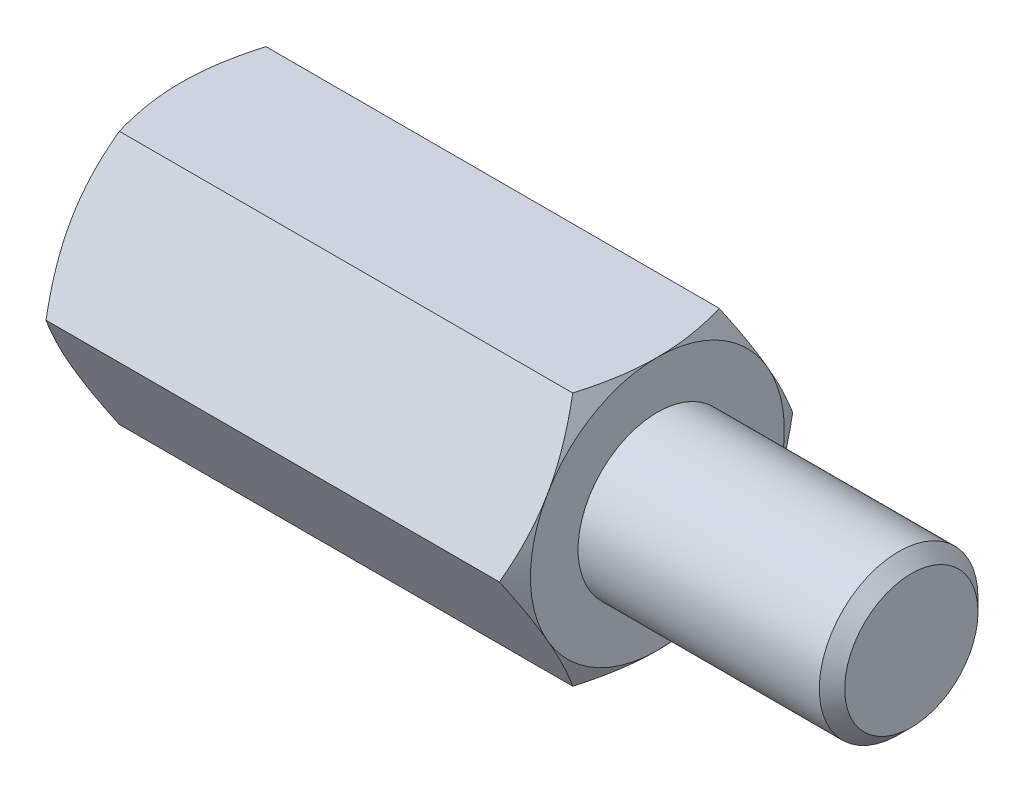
ISO-10303-21;
HEADER;
FILE_DESCRIPTION(('STEP AP214'),'2;1');
FILE_NAME('part.step','',(''),(''),'','','');
FILE_SCHEMA(('AUTOMOTIVE_DESIGN { 1 0 10303 214 1 1 1 1 }'));
ENDSEC;
DATA;
#1=APPLICATION_CONTEXT('core data for automotive mechanical design processes');
#2=APPLICATION_PROTOCOL_DEFINITION('international standard','automotive_design',2000,#1);
#3=PRODUCT_CONTEXT('',#1,'mechanical');
#4=PRODUCT('Part','Part','',(#3));
#5=PRODUCT_RELATED_PRODUCT_CATEGORY('part','',(#4));
#6=PRODUCT_DEFINITION_FORMATION('','',#4);
#7=PRODUCT_DEFINITION_CONTEXT('part definition',#1,'design');
#8=PRODUCT_DEFINITION('design','',#6,#7);
#9=PRODUCT_DEFINITION_SHAPE('','',#8);
#10=(LENGTH_UNIT() NAMED_UNIT(*) SI_UNIT(.MILLI.,.METRE.));
#11=(NAMED_UNIT(*) PLANE_ANGLE_UNIT() SI_UNIT($,.RADIAN.));
#12=(NAMED_UNIT(*) SI_UNIT($,.STERADIAN.) SOLID_ANGLE_UNIT());
#13=UNCERTAINTY_MEASURE_WITH_UNIT(LENGTH_MEASURE(1.E-05),#10,'distance_accuracy_value','');
#14=(GEOMETRIC_REPRESENTATION_CONTEXT(3) GLOBAL_UNCERTAINTY_ASSIGNED_CONTEXT((#13)) GLOBAL_UNIT_ASSIGNED_CONTEXT((#10,
#11,#12)) REPRESENTATION_CONTEXT('',''));
#15=CARTESIAN_POINT('',(0.,0.,0.));
#16=DIRECTION('',(0.,0.,1.));
#17=DIRECTION('',(1.,0.,0.));
#18=AXIS2_PLACEMENT_3D('',#15,#16,#17);
#19=CARTESIAN_POINT('',(7.5,4.,-2.3094010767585));
#20=DIRECTION('',(1.,0.,0.));
#21=DIRECTION('',(0.,0.,-1.));
#22=AXIS2_PLACEMENT_3D('',#19,#20,#21);
#23=PLANE('',#22);
#24=CARTESIAN_POINT('',(7.5,0.,0.));
#25=DIRECTION('',(1.,0.,0.));
#26=DIRECTION('',(0.,0.,-1.));
#27=AXIS2_PLACEMENT_3D('',#24,#25,#26);
#28=CIRCLE('',#27,4.);
#29=CARTESIAN_POINT('',(7.5,-2.,-3.46410161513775));
#30=VERTEX_POINT('',#29);
#31=CARTESIAN_POINT('',(7.5,2.,-3.46410161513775));
#32=VERTEX_POINT('',#31);
#33=EDGE_CURVE('E288',#30,#32,#28,.T.);
#34=ORIENTED_EDGE('',*,*,#33,.T.);
#35=CARTESIAN_POINT('',(7.5,4.,0.));
#36=VERTEX_POINT('',#35);
#37=EDGE_CURVE('E53',#32,#36,#28,.T.);
#38=ORIENTED_EDGE('',*,*,#37,.T.);
#39=CARTESIAN_POINT('',(7.5,2.,3.46410161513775));
#40=VERTEX_POINT('',#39);
#41=EDGE_CURVE('E296',#36,#40,#28,.T.);
#42=ORIENTED_EDGE('',*,*,#41,.T.);
#43=CARTESIAN_POINT('',(7.5,-2.,3.46410161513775));
#44=VERTEX_POINT('',#43);
#45=EDGE_CURVE('E302',#40,#44,#28,.T.);
#46=ORIENTED_EDGE('',*,*,#45,.T.);
#47=CARTESIAN_POINT('',(7.5,0.,0.));
#48=DIRECTION('',(-1.,0.,0.));
#49=DIRECTION('',(0.,-1.,0.));
#50=AXIS2_PLACEMENT_3D('',#47,#48,#49);
#51=CIRCLE('',#50,4.);
#52=CARTESIAN_POINT('',(7.5,-4.,0.));
#53=VERTEX_POINT('',#52);
#54=EDGE_CURVE('E193',#53,#44,#51,.T.);
#55=ORIENTED_EDGE('',*,*,#54,.F.);
#56=EDGE_CURVE('E61',#53,#30,#28,.T.);
#57=ORIENTED_EDGE('',*,*,#56,.T.);
#58=EDGE_LOOP('',(#34,#38,#42,#46,#55,#57));
#59=FACE_BOUND('',#58,.T.);
#60=CARTESIAN_POINT('',(7.5,0.,0.));
#61=DIRECTION('',(1.,0.,0.));
#62=DIRECTION('',(0.,0.,-1.));
#63=AXIS2_PLACEMENT_3D('',#60,#61,#62);
#64=CIRCLE('',#63,2.5);
#65=CARTESIAN_POINT('',(7.5,0.,-2.5));
#66=VERTEX_POINT('',#65);
#67=EDGE_CURVE('E326',#66,#66,#64,.T.);
#68=ORIENTED_EDGE('',*,*,#67,.F.);
#69=EDGE_LOOP('',(#68));
#70=FACE_BOUND('',#69,.T.);
#71=ADVANCED_FACE('F37',(#59,#70),#23,.T.);
#72=CARTESIAN_POINT('',(7.5,0.,-4.61880215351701));
#73=DIRECTION('',(0.,-0.5,0.866025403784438));
#74=DIRECTION('',(0.,-0.866025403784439,-0.5));
#75=AXIS2_PLACEMENT_3D('',#72,#73,#74);
#76=PLANE('',#75);
#77=CARTESIAN_POINT('',(7.14266774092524,-0.000200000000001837,-4.61891762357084));
#78=CARTESIAN_POINT('',(7.20128212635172,0.175579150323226,-4.5174314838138));
#79=CARTESIAN_POINT('',(7.25458967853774,0.352875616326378,-4.41506932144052));
#80=CARTESIAN_POINT('',(7.3476383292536,0.710538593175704,-4.2085725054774));
#81=CARTESIAN_POINT('',(7.3873465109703,0.890911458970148,-4.10443418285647));
#82=CARTESIAN_POINT('',(7.44915778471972,1.24942181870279,-3.89744813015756));
#83=CARTESIAN_POINT('',(7.47167226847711,1.42750415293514,-3.79463224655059));
#84=CARTESIAN_POINT('',(7.49854937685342,1.78450671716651,-3.58851671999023));
#85=CARTESIAN_POINT('',(7.50293425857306,1.9634256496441,-3.48521782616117));
#86=CARTESIAN_POINT('',(7.49380992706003,2.29774284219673,-3.29219970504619));
#87=CARTESIAN_POINT('',(7.48254104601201,2.45319115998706,-3.20245157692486));
#88=CARTESIAN_POINT('',(7.44682600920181,2.76307505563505,-3.02354002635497));
#89=CARTESIAN_POINT('',(7.42236765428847,2.91750956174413,-2.93437722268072));
#90=CARTESIAN_POINT('',(7.36122393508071,3.22803232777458,-2.75509682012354));
#91=CARTESIAN_POINT('',(7.32427939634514,3.3840812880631,-2.6650019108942));
#92=CARTESIAN_POINT('',(7.24042992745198,3.69385183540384,-2.486155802));
#93=CARTESIAN_POINT('',(7.19354469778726,3.84757739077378,-2.39740231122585));
#94=CARTESIAN_POINT('',(7.14266774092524,4.0002,-2.30928560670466));
#95=B_SPLINE_CURVE_WITH_KNOTS('',3,(#77,#78,#79,#80,#81,#82,#83,#84,#85,#86,#87,#88,#89,#90,#91,
#92,#93,#94),.UNSPECIFIED.,.F.,.F.,(4,2,2,2,2,2,2,2,4),(0.,0.634047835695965,1.26961969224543,
1.88946157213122,2.50854226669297,3.04757825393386,3.58711366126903,4.13861653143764,
4.68903648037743),.UNSPECIFIED.);
#96=CARTESIAN_POINT('',(7.14273441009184,0.,-4.61880215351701));
#97=VERTEX_POINT('',#96);
#98=EDGE_CURVE('E364',#97,#32,#95,.T.);
#99=ORIENTED_EDGE('',*,*,#98,.F.);
#100=DIRECTION('',(-1.,0.,0.));
#101=VECTOR('',#100,1.);
#102=CARTESIAN_POINT('',(7.5,0.,-4.61880215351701));
#103=LINE('',#102,#101);
#104=CARTESIAN_POINT('',(-7.14273441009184,0.,-4.61880215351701));
#105=VERTEX_POINT('',#104);
#106=EDGE_CURVE('E264',#97,#105,#103,.T.);
#107=ORIENTED_EDGE('',*,*,#106,.T.);
#108=CARTESIAN_POINT('',(-7.14266774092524,4.0002,-2.30928560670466));
#109=CARTESIAN_POINT('',(-7.20128212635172,3.82442084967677,-2.4107717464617));
#110=CARTESIAN_POINT('',(-7.25458967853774,3.64712438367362,-2.51313390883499));
#111=CARTESIAN_POINT('',(-7.3476383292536,3.28946140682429,-2.71963072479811));
#112=CARTESIAN_POINT('',(-7.3873465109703,3.10908854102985,-2.82376904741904));
#113=CARTESIAN_POINT('',(-7.44915778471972,2.75057818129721,-3.03075510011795));
#114=CARTESIAN_POINT('',(-7.47167226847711,2.57249584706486,-3.13357098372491));
#115=CARTESIAN_POINT('',(-7.49854937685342,2.21549328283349,-3.33968651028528));
#116=CARTESIAN_POINT('',(-7.50293425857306,2.0365743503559,-3.44298540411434));
#117=CARTESIAN_POINT('',(-7.49380992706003,1.70225715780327,-3.63600352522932));
#118=CARTESIAN_POINT('',(-7.48254104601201,1.54680884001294,-3.72575165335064));
#119=CARTESIAN_POINT('',(-7.44682600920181,1.23692494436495,-3.90466320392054));
#120=CARTESIAN_POINT('',(-7.42236765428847,1.08249043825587,-3.99382600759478));
#121=CARTESIAN_POINT('',(-7.36122393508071,0.771967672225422,-4.17310641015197));
#122=CARTESIAN_POINT('',(-7.32427939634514,0.615918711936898,-4.26320131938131));
#123=CARTESIAN_POINT('',(-7.24042992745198,0.30614816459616,-4.4420474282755));
#124=CARTESIAN_POINT('',(-7.19354469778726,0.152422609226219,-4.53080091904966));
#125=CARTESIAN_POINT('',(-7.14266774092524,-0.000200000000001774,-4.61891762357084));
#126=B_SPLINE_CURVE_WITH_KNOTS('',3,(#108,#109,#110,#111,#112,#113,#114,#115,#116,#117,#118,
#119,#120,#121,#122,#123,#124,#125),.UNSPECIFIED.,.F.,.F.,(4,2,2,2,2,2,2,2,4),(0.,
0.634047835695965,1.26961969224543,1.88946157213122,2.50854226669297,3.04757825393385,
3.58711366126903,4.13861653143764,4.68903648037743),.UNSPECIFIED.);
#127=CARTESIAN_POINT('',(-7.5,2.,-3.46410161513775));
#128=VERTEX_POINT('',#127);
#129=EDGE_CURVE('E416',#128,#105,#126,.T.);
#130=ORIENTED_EDGE('',*,*,#129,.F.);
#131=CARTESIAN_POINT('',(-7.14273441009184,4.,-2.3094010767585));
#132=VERTEX_POINT('',#131);
#133=EDGE_CURVE('E399',#132,#128,#126,.T.);
#134=ORIENTED_EDGE('',*,*,#133,.F.);
#135=DIRECTION('',(-1.,0.,0.));
#136=VECTOR('',#135,1.);
#137=CARTESIAN_POINT('',(7.5,4.,-2.3094010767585));
#138=LINE('',#137,#136);
#139=CARTESIAN_POINT('',(7.14273441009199,4.,-2.30940107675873));
#140=VERTEX_POINT('',#139);
#141=EDGE_CURVE('E279',#140,#132,#138,.T.);
#142=ORIENTED_EDGE('',*,*,#141,.F.);
#143=EDGE_CURVE('E229',#32,#140,#95,.T.);
#144=ORIENTED_EDGE('',*,*,#143,.F.);
#145=EDGE_LOOP('',(#99,#107,#130,#134,#142,#144));
#146=FACE_BOUND('',#145,.T.);
#147=ADVANCED_FACE('F148',(#146),#76,.F.);
#148=CARTESIAN_POINT('',(7.5,4.,-2.3094010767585));
#149=DIRECTION('',(0.,-1.,0.));
#150=DIRECTION('',(0.,0.,-1.));
#151=AXIS2_PLACEMENT_3D('',#148,#149,#150);
#152=PLANE('',#151);
#153=CARTESIAN_POINT('',(5.50829070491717,4.,-6.28479524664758));
#154=CARTESIAN_POINT('',(5.59370060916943,4.,-6.10939349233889));
#155=CARTESIAN_POINT('',(5.6783148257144,4.,-5.93359774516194));
#156=CARTESIAN_POINT('',(5.84550596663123,4.,-5.58100905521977));
#157=CARTESIAN_POINT('',(5.92808258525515,4.,-5.40421596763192));
#158=CARTESIAN_POINT('',(6.09115082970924,4.,-5.04855089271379));
#159=CARTESIAN_POINT('',(6.17162934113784,4.,-4.86967287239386));
#160=CARTESIAN_POINT('',(6.32940015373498,4.,-4.51052237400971));
#161=CARTESIAN_POINT('',(6.40669260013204,4.,-4.33024995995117));
#162=CARTESIAN_POINT('',(6.55980205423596,4.,-3.96189114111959));
#163=CARTESIAN_POINT('',(6.63548049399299,4.,-3.77374683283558));
#164=CARTESIAN_POINT('',(6.78130452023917,4.,-3.39528725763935));
#165=CARTESIAN_POINT('',(6.85144949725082,4.,-3.2049717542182));
#166=CARTESIAN_POINT('',(6.9844245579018,4.,-2.82219775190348));
#167=CARTESIAN_POINT('',(7.0472687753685,4.,-2.62974421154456));
#168=CARTESIAN_POINT('',(7.16367969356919,4.,-2.24207725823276));
#169=CARTESIAN_POINT('',(7.21724923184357,4.,-2.04686470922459));
#170=CARTESIAN_POINT('',(7.31230316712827,4.,-1.65467425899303));
#171=CARTESIAN_POINT('',(7.35385633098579,4.,-1.45771333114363));
#172=CARTESIAN_POINT('',(7.42259036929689,4.,-1.06125849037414));
#173=CARTESIAN_POINT('',(7.44977273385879,4.,-0.861764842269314));
#174=CARTESIAN_POINT('',(7.48724473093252,4.,-0.46387918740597));
#175=CARTESIAN_POINT('',(7.49775780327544,4.,-0.265508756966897));
#176=CARTESIAN_POINT('',(7.50159342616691,4.,0.131417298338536));
#177=CARTESIAN_POINT('',(7.49491584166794,4.,0.329972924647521));
#178=CARTESIAN_POINT('',(7.46964892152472,4.,0.66469218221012));
#179=CARTESIAN_POINT('',(7.45537089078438,4.,0.801202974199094));
#180=CARTESIAN_POINT('',(7.4195349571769,4.,1.07327201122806));
#181=CARTESIAN_POINT('',(7.39797613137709,4.,1.20883013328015));
#182=CARTESIAN_POINT('',(7.32350663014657,4.,1.61386939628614));
#183=CARTESIAN_POINT('',(7.26081499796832,4.,1.8815748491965));
#184=CARTESIAN_POINT('',(7.15151174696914,4.,2.28197262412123));
#185=CARTESIAN_POINT('',(7.11200931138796,4.,2.41672443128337));
#186=CARTESIAN_POINT('',(7.02875235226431,4.,2.6849206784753));
#187=CARTESIAN_POINT('',(6.98499779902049,4.,2.81836510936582));
#188=CARTESIAN_POINT('',(6.8939510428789,4.,3.08398596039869));
#189=CARTESIAN_POINT('',(6.84665989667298,4.,3.21616274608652));
#190=CARTESIAN_POINT('',(6.74911111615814,4.,3.47941134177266));
#191=CARTESIAN_POINT('',(6.6988535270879,4.,3.61048316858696));
#192=CARTESIAN_POINT('',(6.57132952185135,4.,3.93385125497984));
#193=CARTESIAN_POINT('',(6.4926014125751,4.,4.1255702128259));
#194=CARTESIAN_POINT('',(6.33096938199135,4.,4.5072455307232));
#195=CARTESIAN_POINT('',(6.24806513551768,4.,4.69720175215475));
#196=CARTESIAN_POINT('',(6.0789699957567,4.,5.0756995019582));
#197=CARTESIAN_POINT('',(5.99277827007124,4.,5.264240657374));
#198=CARTESIAN_POINT('',(5.8178011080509,4.,5.64011758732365));
#199=CARTESIAN_POINT('',(5.72901560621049,4.,5.82745333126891));
#200=CARTESIAN_POINT('',(5.45934323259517,4.,6.3884442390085));
#201=CARTESIAN_POINT('',(5.27535618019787,4.,6.76060781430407));
#202=CARTESIAN_POINT('',(4.9019562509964,4.,7.50211228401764));
#203=CARTESIAN_POINT('',(4.71254420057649,4.,7.87145359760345));
#204=CARTESIAN_POINT('',(4.34738774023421,4.,8.57450173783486));
#205=CARTESIAN_POINT('',(4.17197556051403,4.,8.90838144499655));
#206=CARTESIAN_POINT('',(3.81880976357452,4.,9.57491712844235));
#207=CARTESIAN_POINT('',(3.64105604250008,4.,9.90757304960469));
#208=CARTESIAN_POINT('',(3.28429339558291,4.,10.5709822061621));
#209=CARTESIAN_POINT('',(3.10528952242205,3.99999999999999,10.9017381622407));
#210=CARTESIAN_POINT('',(2.74590712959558,3.99999999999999,11.5624752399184));
#211=CARTESIAN_POINT('',(2.56552869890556,3.99999999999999,11.8924564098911));
#212=CARTESIAN_POINT('',(2.38464248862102,3.99999999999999,12.2221569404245));
#213=B_SPLINE_CURVE_WITH_KNOTS('',3,(#153,#154,#155,#156,#157,#158,#159,#160,#161,#162,#163,
#164,#165,#166,#167,#168,#169,#170,#171,#172,#173,#174,#175,#176,#177,#178,#179,#180,#181,#182,
#183,#184,#185,#186,#187,#188,#189,#190,#191,#192,#193,#194,#195,#196,#197,#198,#199,#200,#201,
#202,#203,#204,#205,#206,#207,#208,#209,#210,#211,#212),.UNSPECIFIED.,.F.,.F.,(4,2,2,2,2,2,2,2,
2,2,2,2,2,2,2,2,2,2,2,2,2,2,2,2,2,2,2,2,2,4),(0.,0.585280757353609,1.17064881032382,
1.75906864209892,2.34746162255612,2.95577704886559,3.56415938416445,4.17134357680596,
4.77834167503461,5.38179402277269,5.98518378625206,6.58041501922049,7.17565092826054,
7.5872191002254,7.99883946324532,8.82250155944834,9.24373134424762,9.66496407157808,
10.086071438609,10.5071723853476,11.1288656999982,11.7506074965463,12.3725077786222,
12.9944237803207,14.2398211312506,15.4850297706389,16.6164791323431,17.7479788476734,
18.8762380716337,20.0044248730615),.UNSPECIFIED.);
#214=EDGE_CURVE('E227',#140,#36,#213,.T.);
#215=ORIENTED_EDGE('',*,*,#214,.F.);
#216=ORIENTED_EDGE('',*,*,#141,.T.);
#217=CARTESIAN_POINT('',(-5.50829070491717,4.,-6.28479524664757));
#218=CARTESIAN_POINT('',(-5.59370060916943,4.,-6.10939349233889));
#219=CARTESIAN_POINT('',(-5.6783148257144,4.,-5.93359774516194));
#220=CARTESIAN_POINT('',(-5.84550596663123,4.,-5.58100905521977));
#221=CARTESIAN_POINT('',(-5.92808258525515,4.,-5.40421596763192));
#222=CARTESIAN_POINT('',(-6.09115082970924,4.,-5.04855089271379));
#223=CARTESIAN_POINT('',(-6.17162934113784,4.,-4.86967287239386));
#224=CARTESIAN_POINT('',(-6.32940015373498,4.,-4.51052237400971));
#225=CARTESIAN_POINT('',(-6.40669260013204,4.,-4.33024995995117));
#226=CARTESIAN_POINT('',(-6.55980205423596,4.,-3.96189114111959));
#227=CARTESIAN_POINT('',(-6.635480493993,4.,-3.77374683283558));
#228=CARTESIAN_POINT('',(-6.78130452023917,4.,-3.39528725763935));
#229=CARTESIAN_POINT('',(-6.85144949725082,4.,-3.2049717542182));
#230=CARTESIAN_POINT('',(-6.9844245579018,4.,-2.82219775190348));
#231=CARTESIAN_POINT('',(-7.0472687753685,4.,-2.62974421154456));
#232=CARTESIAN_POINT('',(-7.16367969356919,4.,-2.24207725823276));
#233=CARTESIAN_POINT('',(-7.21724923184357,4.,-2.04686470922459));
#234=CARTESIAN_POINT('',(-7.31230316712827,4.,-1.65467425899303));
#235=CARTESIAN_POINT('',(-7.35385633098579,4.,-1.45771333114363));
#236=CARTESIAN_POINT('',(-7.42259036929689,4.,-1.06125849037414));
#237=CARTESIAN_POINT('',(-7.44977273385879,4.,-0.861764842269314));
#238=CARTESIAN_POINT('',(-7.48724473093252,4.,-0.46387918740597));
#239=CARTESIAN_POINT('',(-7.49775780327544,4.,-0.265508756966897));
#240=CARTESIAN_POINT('',(-7.50159342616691,4.,0.131417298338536));
#241=CARTESIAN_POINT('',(-7.49491584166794,4.,0.329972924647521));
#242=CARTESIAN_POINT('',(-7.46964892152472,4.,0.66469218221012));
#243=CARTESIAN_POINT('',(-7.45537089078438,4.,0.801202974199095));
#244=CARTESIAN_POINT('',(-7.4195349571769,4.,1.07327201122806));
#245=CARTESIAN_POINT('',(-7.39797613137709,4.,1.20883013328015));
#246=CARTESIAN_POINT('',(-7.32350663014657,4.,1.61386939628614));
#247=CARTESIAN_POINT('',(-7.26081499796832,4.,1.8815748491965));
#248=CARTESIAN_POINT('',(-7.15151174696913,4.,2.28197262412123));
#249=CARTESIAN_POINT('',(-7.11200931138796,4.,2.41672443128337));
#250=CARTESIAN_POINT('',(-7.02875235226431,4.,2.68492067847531));
#251=CARTESIAN_POINT('',(-6.98499779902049,4.,2.81836510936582));
#252=CARTESIAN_POINT('',(-6.8939510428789,4.,3.08398596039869));
#253=CARTESIAN_POINT('',(-6.84665989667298,4.,3.21616274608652));
#254=CARTESIAN_POINT('',(-6.74911111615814,4.,3.47941134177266));
#255=CARTESIAN_POINT('',(-6.6988535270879,4.,3.61048316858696));
#256=CARTESIAN_POINT('',(-6.57132952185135,4.,3.93385125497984));
#257=CARTESIAN_POINT('',(-6.4926014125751,4.,4.1255702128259));
#258=CARTESIAN_POINT('',(-6.33096938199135,4.,4.5072455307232));
#259=CARTESIAN_POINT('',(-6.24806513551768,4.,4.69720175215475));
#260=CARTESIAN_POINT('',(-6.0789699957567,4.,5.0756995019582));
#261=CARTESIAN_POINT('',(-5.99277827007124,4.,5.264240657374));
#262=CARTESIAN_POINT('',(-5.8178011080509,4.,5.64011758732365));
#263=CARTESIAN_POINT('',(-5.72901560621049,4.,5.82745333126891));
#264=CARTESIAN_POINT('',(-5.45934323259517,4.,6.3884442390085));
#265=CARTESIAN_POINT('',(-5.27535618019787,4.,6.76060781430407));
#266=CARTESIAN_POINT('',(-4.9019562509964,4.,7.50211228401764));
#267=CARTESIAN_POINT('',(-4.71254420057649,4.,7.87145359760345));
#268=CARTESIAN_POINT('',(-4.34738774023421,4.,8.57450173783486));
#269=CARTESIAN_POINT('',(-4.17197556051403,4.,8.90838144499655));
#270=CARTESIAN_POINT('',(-3.81880976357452,4.,9.57491712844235));
#271=CARTESIAN_POINT('',(-3.64105604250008,4.,9.9075730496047));
#272=CARTESIAN_POINT('',(-3.28429339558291,4.,10.5709822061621));
#273=CARTESIAN_POINT('',(-3.10528952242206,3.99999999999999,10.9017381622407));
#274=CARTESIAN_POINT('',(-2.74590712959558,3.99999999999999,11.5624752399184));
#275=CARTESIAN_POINT('',(-2.56552869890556,3.99999999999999,11.8924564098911));
#276=CARTESIAN_POINT('',(-2.38464248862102,3.99999999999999,12.2221569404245));
#277=B_SPLINE_CURVE_WITH_KNOTS('',3,(#217,#218,#219,#220,#221,#222,#223,#224,#225,#226,#227,
#228,#229,#230,#231,#232,#233,#234,#235,#236,#237,#238,#239,#240,#241,#242,#243,#244,#245,#246,
#247,#248,#249,#250,#251,#252,#253,#254,#255,#256,#257,#258,#259,#260,#261,#262,#263,#264,#265,
#266,#267,#268,#269,#270,#271,#272,#273,#274,#275,#276),.UNSPECIFIED.,.F.,.F.,(4,2,2,2,2,2,2,2,
2,2,2,2,2,2,2,2,2,2,2,2,2,2,2,2,2,2,2,2,2,4),(0.,0.585280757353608,1.17064881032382,
1.75906864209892,2.34746162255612,2.95577704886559,3.56415938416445,4.17134357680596,
4.7783416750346,5.38179402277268,5.98518378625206,6.58041501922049,7.17565092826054,
7.5872191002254,7.99883946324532,8.82250155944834,9.24373134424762,9.66496407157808,
10.086071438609,10.5071723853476,11.1288656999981,11.7506074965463,12.3725077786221,
12.9944237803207,14.2398211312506,15.4850297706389,16.6164791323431,17.7479788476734,
18.8762380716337,20.0044248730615),.UNSPECIFIED.);
#278=CARTESIAN_POINT('',(-7.5,4.,0.));
#279=VERTEX_POINT('',#278);
#280=EDGE_CURVE('E241',#279,#132,#277,.F.);
#281=ORIENTED_EDGE('',*,*,#280,.F.);
#282=CARTESIAN_POINT('',(-7.14273441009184,4.,2.3094010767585));
#283=VERTEX_POINT('',#282);
#284=EDGE_CURVE('E249',#283,#279,#277,.F.);
#285=ORIENTED_EDGE('',*,*,#284,.F.);
#286=DIRECTION('',(-1.,0.,0.));
#287=VECTOR('',#286,1.);
#288=CARTESIAN_POINT('',(7.5,4.,2.3094010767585));
#289=LINE('',#288,#287);
#290=CARTESIAN_POINT('',(7.14273441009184,4.,2.3094010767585));
#291=VERTEX_POINT('',#290);
#292=EDGE_CURVE('E276',#291,#283,#289,.T.);
#293=ORIENTED_EDGE('',*,*,#292,.F.);
#294=EDGE_CURVE('E221',#36,#291,#213,.T.);
#295=ORIENTED_EDGE('',*,*,#294,.F.);
#296=EDGE_LOOP('',(#215,#216,#281,#285,#293,#295));
#297=FACE_BOUND('',#296,.T.);
#298=ADVANCED_FACE('F153',(#297),#152,.F.);
#299=CARTESIAN_POINT('',(7.5,4.,2.3094010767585));
#300=DIRECTION('',(0.,-0.5,-0.866025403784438));
#301=DIRECTION('',(0.,0.866025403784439,-0.5));
#302=AXIS2_PLACEMENT_3D('',#299,#300,#301);
#303=PLANE('',#302);
#304=CARTESIAN_POINT('',(7.14266774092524,4.0002,2.30928560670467));
#305=CARTESIAN_POINT('',(7.20128212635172,3.82442084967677,2.4107717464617));
#306=CARTESIAN_POINT('',(7.25458967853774,3.64712438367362,2.51313390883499));
#307=CARTESIAN_POINT('',(7.3476383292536,3.28946140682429,2.71963072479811));
#308=CARTESIAN_POINT('',(7.3873465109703,3.10908854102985,2.82376904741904));
#309=CARTESIAN_POINT('',(7.44915778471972,2.75057818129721,3.03075510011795));
#310=CARTESIAN_POINT('',(7.47167226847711,2.57249584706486,3.13357098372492));
#311=CARTESIAN_POINT('',(7.49854937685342,2.21549328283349,3.33968651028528));
#312=CARTESIAN_POINT('',(7.50293425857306,2.0365743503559,3.44298540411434));
#313=CARTESIAN_POINT('',(7.49380992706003,1.70225715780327,3.63600352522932));
#314=CARTESIAN_POINT('',(7.48254104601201,1.54680884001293,3.72575165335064));
#315=CARTESIAN_POINT('',(7.44682600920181,1.23692494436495,3.90466320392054));
#316=CARTESIAN_POINT('',(7.42236765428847,1.08249043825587,3.99382600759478));
#317=CARTESIAN_POINT('',(7.36122393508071,0.771967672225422,4.17310641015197));
#318=CARTESIAN_POINT('',(7.32427939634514,0.615918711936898,4.26320131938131));
#319=CARTESIAN_POINT('',(7.24042992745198,0.306148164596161,4.4420474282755));
#320=CARTESIAN_POINT('',(7.19354469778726,0.152422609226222,4.53080091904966));
#321=CARTESIAN_POINT('',(7.14266774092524,-0.000199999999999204,4.61891762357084));
#322=B_SPLINE_CURVE_WITH_KNOTS('',3,(#304,#305,#306,#307,#308,#309,#310,#311,#312,#313,#314,
#315,#316,#317,#318,#319,#320,#321),.UNSPECIFIED.,.F.,.F.,(4,2,2,2,2,2,2,2,4),(0.,
0.634047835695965,1.26961969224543,1.88946157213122,2.50854226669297,3.04757825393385,
3.58711366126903,4.13861653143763,4.68903648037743),.UNSPECIFIED.);
#323=EDGE_CURVE('E228',#291,#40,#322,.T.);
#324=ORIENTED_EDGE('',*,*,#323,.F.);
#325=ORIENTED_EDGE('',*,*,#292,.T.);
#326=CARTESIAN_POINT('',(-7.14266774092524,-0.000199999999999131,4.61891762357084));
#327=CARTESIAN_POINT('',(-7.20128212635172,0.175579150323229,4.5174314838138));
#328=CARTESIAN_POINT('',(-7.25458967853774,0.352875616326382,4.41506932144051));
#329=CARTESIAN_POINT('',(-7.3476383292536,0.710538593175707,4.20857250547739));
#330=CARTESIAN_POINT('',(-7.3873465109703,0.890911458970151,4.10443418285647));
#331=CARTESIAN_POINT('',(-7.44915778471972,1.24942181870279,3.89744813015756));
#332=CARTESIAN_POINT('',(-7.47167226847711,1.42750415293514,3.79463224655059));
#333=CARTESIAN_POINT('',(-7.49854937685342,1.78450671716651,3.58851671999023));
#334=CARTESIAN_POINT('',(-7.50293425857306,1.9634256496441,3.48521782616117));
#335=CARTESIAN_POINT('',(-7.49380992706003,2.29774284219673,3.29219970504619));
#336=CARTESIAN_POINT('',(-7.48254104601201,2.45319115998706,3.20245157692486));
#337=CARTESIAN_POINT('',(-7.44682600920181,2.76307505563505,3.02354002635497));
#338=CARTESIAN_POINT('',(-7.42236765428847,2.91750956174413,2.93437722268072));
#339=CARTESIAN_POINT('',(-7.36122393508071,3.22803232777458,2.75509682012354));
#340=CARTESIAN_POINT('',(-7.32427939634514,3.3840812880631,2.6650019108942));
#341=CARTESIAN_POINT('',(-7.24042992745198,3.69385183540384,2.48615580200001));
#342=CARTESIAN_POINT('',(-7.19354469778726,3.84757739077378,2.39740231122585));
#343=CARTESIAN_POINT('',(-7.14266774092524,4.0002,2.30928560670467));
#344=B_SPLINE_CURVE_WITH_KNOTS('',3,(#326,#327,#328,#329,#330,#331,#332,#333,#334,#335,#336,
#337,#338,#339,#340,#341,#342,#343),.UNSPECIFIED.,.F.,.F.,(4,2,2,2,2,2,2,2,4),(0.,
0.634047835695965,1.26961969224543,1.88946157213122,2.50854226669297,3.04757825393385,
3.58711366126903,4.13861653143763,4.68903648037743),.UNSPECIFIED.);
#345=CARTESIAN_POINT('',(-7.5,2.,3.46410161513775));
#346=VERTEX_POINT('',#345);
#347=EDGE_CURVE('E255',#346,#283,#344,.T.);
#348=ORIENTED_EDGE('',*,*,#347,.F.);
#349=CARTESIAN_POINT('',(-7.14273441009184,0.,4.618802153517));
#350=VERTEX_POINT('',#349);
#351=EDGE_CURVE('E262',#350,#346,#344,.T.);
#352=ORIENTED_EDGE('',*,*,#351,.F.);
#353=DIRECTION('',(-1.,0.,0.));
#354=VECTOR('',#353,1.);
#355=CARTESIAN_POINT('',(7.5,0.,4.618802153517));
#356=LINE('',#355,#354);
#357=CARTESIAN_POINT('',(7.14273441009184,0.,4.618802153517));
#358=VERTEX_POINT('',#357);
#359=EDGE_CURVE('E273',#358,#350,#356,.T.);
#360=ORIENTED_EDGE('',*,*,#359,.F.);
#361=EDGE_CURVE('E215',#40,#358,#322,.T.);
#362=ORIENTED_EDGE('',*,*,#361,.F.);
#363=EDGE_LOOP('',(#324,#325,#348,#352,#360,#362));
#364=FACE_BOUND('',#363,.T.);
#365=ADVANCED_FACE('F235',(#364),#303,.F.);
#366=CARTESIAN_POINT('',(7.5,0.,4.618802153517));
#367=DIRECTION('',(0.,0.5,-0.866025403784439));
#368=DIRECTION('',(0.,0.866025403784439,0.5));
#369=AXIS2_PLACEMENT_3D('',#366,#367,#368);
#370=PLANE('',#369);
#371=CARTESIAN_POINT('',(7.14266774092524,0.000200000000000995,4.61891762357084));
#372=CARTESIAN_POINT('',(7.20128212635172,-0.175579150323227,4.5174314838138));
#373=CARTESIAN_POINT('',(7.25458967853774,-0.352875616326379,4.41506932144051));
#374=CARTESIAN_POINT('',(7.3476383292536,-0.710538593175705,4.20857250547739));
#375=CARTESIAN_POINT('',(7.3873465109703,-0.890911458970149,4.10443418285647));
#376=CARTESIAN_POINT('',(7.44915778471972,-1.24942181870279,3.89744813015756));
#377=CARTESIAN_POINT('',(7.47167226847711,-1.42750415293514,3.79463224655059));
#378=CARTESIAN_POINT('',(7.49854937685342,-1.78450671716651,3.58851671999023));
#379=CARTESIAN_POINT('',(7.50293425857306,-1.9634256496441,3.48521782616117));
#380=CARTESIAN_POINT('',(7.49380992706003,-2.29774284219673,3.29219970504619));
#381=CARTESIAN_POINT('',(7.48254104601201,-2.45319115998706,3.20245157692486));
#382=CARTESIAN_POINT('',(7.44682600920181,-2.76307505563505,3.02354002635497));
#383=CARTESIAN_POINT('',(7.42236765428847,-2.91750956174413,2.93437722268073));
#384=CARTESIAN_POINT('',(7.36122393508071,-3.22803232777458,2.75509682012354));
#385=CARTESIAN_POINT('',(7.32427939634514,-3.3840812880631,2.6650019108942));
#386=CARTESIAN_POINT('',(7.24042992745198,-3.69385183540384,2.48615580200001));
#387=CARTESIAN_POINT('',(7.19354469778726,-3.84757739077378,2.39740231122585));
#388=CARTESIAN_POINT('',(7.14266774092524,-4.0002,2.30928560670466));
#389=B_SPLINE_CURVE_WITH_KNOTS('',3,(#371,#372,#373,#374,#375,#376,#377,#378,#379,#380,#381,
#382,#383,#384,#385,#386,#387,#388),.UNSPECIFIED.,.F.,.F.,(4,2,2,2,2,2,2,2,4),(0.,
0.634047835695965,1.26961969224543,1.88946157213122,2.50854226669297,3.04757825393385,
3.58711366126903,4.13861653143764,4.68903648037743),.UNSPECIFIED.);
#390=EDGE_CURVE('E384',#358,#44,#389,.T.);
#391=ORIENTED_EDGE('',*,*,#390,.F.);
#392=ORIENTED_EDGE('',*,*,#359,.T.);
#393=CARTESIAN_POINT('',(-7.14266774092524,-4.0002,2.30928560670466));
#394=CARTESIAN_POINT('',(-7.20128212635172,-3.82442084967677,2.4107717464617));
#395=CARTESIAN_POINT('',(-7.25458967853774,-3.64712438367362,2.51313390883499));
#396=CARTESIAN_POINT('',(-7.3476383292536,-3.28946140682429,2.71963072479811));
#397=CARTESIAN_POINT('',(-7.3873465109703,-3.10908854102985,2.82376904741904));
#398=CARTESIAN_POINT('',(-7.44915778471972,-2.75057818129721,3.03075510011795));
#399=CARTESIAN_POINT('',(-7.47167226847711,-2.57249584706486,3.13357098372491));
#400=CARTESIAN_POINT('',(-7.49854937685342,-2.21549328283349,3.33968651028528));
#401=CARTESIAN_POINT('',(-7.50293425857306,-2.0365743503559,3.44298540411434));
#402=CARTESIAN_POINT('',(-7.49380992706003,-1.70225715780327,3.63600352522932));
#403=CARTESIAN_POINT('',(-7.48254104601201,-1.54680884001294,3.72575165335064));
#404=CARTESIAN_POINT('',(-7.44682600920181,-1.23692494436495,3.90466320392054));
#405=CARTESIAN_POINT('',(-7.42236765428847,-1.08249043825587,3.99382600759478));
#406=CARTESIAN_POINT('',(-7.36122393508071,-0.771967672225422,4.17310641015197));
#407=CARTESIAN_POINT('',(-7.32427939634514,-0.615918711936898,4.26320131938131));
#408=CARTESIAN_POINT('',(-7.24042992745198,-0.30614816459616,4.4420474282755));
#409=CARTESIAN_POINT('',(-7.19354469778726,-0.15242260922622,4.53080091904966));
#410=CARTESIAN_POINT('',(-7.14266774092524,0.000200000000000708,4.61891762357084));
#411=B_SPLINE_CURVE_WITH_KNOTS('',3,(#393,#394,#395,#396,#397,#398,#399,#400,#401,#402,#403,
#404,#405,#406,#407,#408,#409,#410),.UNSPECIFIED.,.F.,.F.,(4,2,2,2,2,2,2,2,4),(0.,
0.634047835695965,1.26961969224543,1.88946157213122,2.50854226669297,3.04757825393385,
3.58711366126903,4.13861653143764,4.68903648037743),.UNSPECIFIED.);
#412=CARTESIAN_POINT('',(-7.5,-2.,3.46410161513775));
#413=VERTEX_POINT('',#412);
#414=EDGE_CURVE('E263',#413,#350,#411,.T.);
#415=ORIENTED_EDGE('',*,*,#414,.F.);
#416=CARTESIAN_POINT('',(-7.14273441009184,-4.,2.3094010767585));
#417=VERTEX_POINT('',#416);
#418=EDGE_CURVE('E250',#417,#413,#411,.T.);
#419=ORIENTED_EDGE('',*,*,#418,.F.);
#420=DIRECTION('',(-1.,0.,0.));
#421=VECTOR('',#420,1.);
#422=CARTESIAN_POINT('',(7.5,-4.,2.3094010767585));
#423=LINE('',#422,#421);
#424=CARTESIAN_POINT('',(7.14273441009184,-4.,2.3094010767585));
#425=VERTEX_POINT('',#424);
#426=EDGE_CURVE('E270',#425,#417,#423,.T.);
#427=ORIENTED_EDGE('',*,*,#426,.F.);
#428=EDGE_CURVE('E210',#44,#425,#389,.T.);
#429=ORIENTED_EDGE('',*,*,#428,.F.);
#430=EDGE_LOOP('',(#391,#392,#415,#419,#427,#429));
#431=FACE_BOUND('',#430,.T.);
#432=ADVANCED_FACE('F467',(#431),#370,.F.);
#433=CARTESIAN_POINT('',(7.5,-4.,2.3094010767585));
#434=DIRECTION('',(0.,1.,0.));
#435=DIRECTION('',(0.,0.,1.));
#436=AXIS2_PLACEMENT_3D('',#433,#434,#435);
#437=PLANE('',#436);
#438=CARTESIAN_POINT('',(5.5082907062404,-4.,-6.28479524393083));
#439=CARTESIAN_POINT('',(5.59370061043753,-4.,-6.10939348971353));
#440=CARTESIAN_POINT('',(5.6783148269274,-4.,-5.93359774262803));
#441=CARTESIAN_POINT('',(5.84550596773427,-4.,-5.58100905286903));
#442=CARTESIAN_POINT('',(5.92808258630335,-4.,-5.40421596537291));
#443=CARTESIAN_POINT('',(6.09115083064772,-4.,-5.04855089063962));
#444=CARTESIAN_POINT('',(6.17162934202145,-4.,-4.86967287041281));
#445=CARTESIAN_POINT('',(6.32940015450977,-4.,-4.51052237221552));
#446=CARTESIAN_POINT('',(6.40669260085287,-4.,-4.33024995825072));
#447=CARTESIAN_POINT('',(6.55980205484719,-4.,-3.96189113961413));
#448=CARTESIAN_POINT('',(6.63548049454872,-4.,-3.77374683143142));
#449=CARTESIAN_POINT('',(6.78130452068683,-4.,-3.39528725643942));
#450=CARTESIAN_POINT('',(6.85144949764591,-4.,-3.2049717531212));
#451=CARTESIAN_POINT('',(6.98442455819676,-4.,-2.82219775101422));
#452=CARTESIAN_POINT('',(7.04726877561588,-4.,-2.62974421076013));
#453=CARTESIAN_POINT('',(7.16367969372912,-4.,-2.24207725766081));
#454=CARTESIAN_POINT('',(7.21724923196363,-4.,-2.04686470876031));
#455=CARTESIAN_POINT('',(7.31230316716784,-4.,-1.65467425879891));
#456=CARTESIAN_POINT('',(7.35385633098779,-4.,-1.45771333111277));
#457=CARTESIAN_POINT('',(7.4225903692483,-4.,-1.06125849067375));
#458=CARTESIAN_POINT('',(7.44977273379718,-4.,-0.861764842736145));
#459=CARTESIAN_POINT('',(7.48724473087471,-4.,-0.463879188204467));
#460=CARTESIAN_POINT('',(7.49775780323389,-4.,-0.265508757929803));
#461=CARTESIAN_POINT('',(7.50159342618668,-4.,0.131417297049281));
#462=CARTESIAN_POINT('',(7.49491584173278,-4.,0.329972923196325));
#463=CARTESIAN_POINT('',(7.46964892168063,-4.,0.664692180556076));
#464=CARTESIAN_POINT('',(7.45537089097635,-4.,0.80120297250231));
#465=CARTESIAN_POINT('',(7.4195349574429,-4.,1.07327200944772));
#466=CARTESIAN_POINT('',(7.39797613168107,-4.,1.208830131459));
#467=CARTESIAN_POINT('',(7.32350663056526,-4.,1.6138693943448));
#468=CARTESIAN_POINT('',(7.26081499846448,-4.,1.88157484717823));
#469=CARTESIAN_POINT('',(7.15151174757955,-4.,2.28197262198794));
#470=CARTESIAN_POINT('',(7.1120093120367,-4.,2.41672442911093));
#471=CARTESIAN_POINT('',(7.02875235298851,-4.,2.68492067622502));
#472=CARTESIAN_POINT('',(6.98499779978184,-4.,2.81836510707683));
#473=CARTESIAN_POINT('',(6.89395104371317,-4.,3.0839859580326));
#474=CARTESIAN_POINT('',(6.84665989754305,-4.,3.21616274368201));
#475=CARTESIAN_POINT('',(6.74911111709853,-4.,3.47941133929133));
#476=CARTESIAN_POINT('',(6.69885352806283,-4.,3.61048316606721));
#477=CARTESIAN_POINT('',(6.57132952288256,-4.,3.93385125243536));
#478=CARTESIAN_POINT('',(6.49260141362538,-4.,4.12557021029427));
#479=CARTESIAN_POINT('',(6.330969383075,-4.,4.50724552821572));
#480=CARTESIAN_POINT('',(6.24806513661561,-4.,4.69720174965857));
#481=CARTESIAN_POINT('',(6.07896999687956,-4.,5.07569949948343));
#482=CARTESIAN_POINT('',(5.99277827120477,-4.,5.26424065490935));
#483=CARTESIAN_POINT('',(5.81780110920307,-4.,5.64011758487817));
#484=CARTESIAN_POINT('',(5.72901560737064,-4.,5.82745332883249));
#485=CARTESIAN_POINT('',(5.45934323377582,-4.,6.38844423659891));
#486=CARTESIAN_POINT('',(5.27535618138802,-4.,6.76060781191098));
#487=CARTESIAN_POINT('',(4.90195625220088,-4.,7.50211228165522));
#488=CARTESIAN_POINT('',(4.71254420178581,-4.,7.87145359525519));
#489=CARTESIAN_POINT('',(4.34738774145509,-4.,8.57450173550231));
#490=CARTESIAN_POINT('',(4.171975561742,-4.,8.90838144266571));
#491=CARTESIAN_POINT('',(3.81880976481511,-4.,9.5749171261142));
#492=CARTESIAN_POINT('',(3.6410560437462,-4.,9.90757304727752));
#493=CARTESIAN_POINT('',(3.28429339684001,-4.,10.5709822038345));
#494=CARTESIAN_POINT('',(3.10528952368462,-4.,10.9017381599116));
#495=CARTESIAN_POINT('',(2.74590713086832,-4.,11.562475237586));
#496=CARTESIAN_POINT('',(2.56552870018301,-4.,11.8924564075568));
#497=CARTESIAN_POINT('',(2.38464248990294,-4.,12.2221569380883));
#498=B_SPLINE_CURVE_WITH_KNOTS('',3,(#438,#439,#440,#441,#442,#443,#444,#445,#446,#447,#448,
#449,#450,#451,#452,#453,#454,#455,#456,#457,#458,#459,#460,#461,#462,#463,#464,#465,#466,#467,
#468,#469,#470,#471,#472,#473,#474,#475,#476,#477,#478,#479,#480,#481,#482,#483,#484,#485,#486,
#487,#488,#489,#490,#491,#492,#493,#494,#495,#496,#497),.UNSPECIFIED.,.F.,.F.,(4,2,2,2,2,2,2,2,
2,2,2,2,2,2,2,2,2,2,2,2,2,2,2,2,2,2,2,2,2,4),(0.,0.585280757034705,1.17064880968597,
1.75906864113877,2.34746162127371,2.95577704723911,3.56415938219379,4.17134357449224,
4.7783416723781,5.38179401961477,5.98518378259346,6.58041501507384,7.1756509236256,
7.5872190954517,7.99883945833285,8.82250155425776,9.24373133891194,9.66496406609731,
10.0860714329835,10.5071723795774,11.1288656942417,11.7506074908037,12.3725077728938,
12.9944237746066,14.2398211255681,15.4850297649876,16.6164791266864,17.7479788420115,
18.8762380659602,20.0044248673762),.UNSPECIFIED.);
#499=EDGE_CURVE('E389',#425,#53,#498,.F.);
#500=ORIENTED_EDGE('',*,*,#499,.F.);
#501=ORIENTED_EDGE('',*,*,#426,.T.);
#502=CARTESIAN_POINT('',(-5.5082907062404,-4.,-6.28479524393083));
#503=CARTESIAN_POINT('',(-5.59370061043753,-4.,-6.10939348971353));
#504=CARTESIAN_POINT('',(-5.6783148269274,-4.,-5.93359774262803));
#505=CARTESIAN_POINT('',(-5.84550596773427,-4.,-5.58100905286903));
#506=CARTESIAN_POINT('',(-5.92808258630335,-4.,-5.40421596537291));
#507=CARTESIAN_POINT('',(-6.09115083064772,-4.,-5.04855089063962));
#508=CARTESIAN_POINT('',(-6.17162934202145,-4.,-4.86967287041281));
#509=CARTESIAN_POINT('',(-6.32940015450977,-4.,-4.51052237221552));
#510=CARTESIAN_POINT('',(-6.40669260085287,-4.,-4.33024995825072));
#511=CARTESIAN_POINT('',(-6.55980205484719,-4.,-3.96189113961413));
#512=CARTESIAN_POINT('',(-6.63548049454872,-4.,-3.77374683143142));
#513=CARTESIAN_POINT('',(-6.78130452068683,-4.,-3.39528725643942));
#514=CARTESIAN_POINT('',(-6.85144949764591,-4.,-3.2049717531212));
#515=CARTESIAN_POINT('',(-6.98442455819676,-4.,-2.82219775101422));
#516=CARTESIAN_POINT('',(-7.04726877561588,-4.,-2.62974421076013));
#517=CARTESIAN_POINT('',(-7.16367969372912,-4.,-2.24207725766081));
#518=CARTESIAN_POINT('',(-7.21724923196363,-4.,-2.04686470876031));
#519=CARTESIAN_POINT('',(-7.31230316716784,-4.,-1.65467425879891));
#520=CARTESIAN_POINT('',(-7.35385633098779,-4.,-1.45771333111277));
#521=CARTESIAN_POINT('',(-7.4225903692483,-4.,-1.06125849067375));
#522=CARTESIAN_POINT('',(-7.44977273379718,-4.,-0.861764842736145));
#523=CARTESIAN_POINT('',(-7.48724473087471,-4.,-0.463879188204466));
#524=CARTESIAN_POINT('',(-7.49775780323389,-4.,-0.265508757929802));
#525=CARTESIAN_POINT('',(-7.50159342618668,-4.,0.131417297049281));
#526=CARTESIAN_POINT('',(-7.49491584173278,-4.,0.329972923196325));
#527=CARTESIAN_POINT('',(-7.46964892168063,-4.,0.664692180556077));
#528=CARTESIAN_POINT('',(-7.45537089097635,-4.,0.801202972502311));
#529=CARTESIAN_POINT('',(-7.4195349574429,-4.,1.07327200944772));
#530=CARTESIAN_POINT('',(-7.39797613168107,-4.,1.208830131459));
#531=CARTESIAN_POINT('',(-7.32350663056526,-4.,1.6138693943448));
#532=CARTESIAN_POINT('',(-7.26081499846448,-4.,1.88157484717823));
#533=CARTESIAN_POINT('',(-7.15151174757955,-4.,2.28197262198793));
#534=CARTESIAN_POINT('',(-7.1120093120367,-4.,2.41672442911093));
#535=CARTESIAN_POINT('',(-7.02875235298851,-4.,2.68492067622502));
#536=CARTESIAN_POINT('',(-6.98499779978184,-4.,2.81836510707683));
#537=CARTESIAN_POINT('',(-6.89395104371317,-4.,3.0839859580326));
#538=CARTESIAN_POINT('',(-6.84665989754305,-4.,3.21616274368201));
#539=CARTESIAN_POINT('',(-6.74911111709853,-4.,3.47941133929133));
#540=CARTESIAN_POINT('',(-6.69885352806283,-4.,3.61048316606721));
#541=CARTESIAN_POINT('',(-6.57132952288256,-4.,3.93385125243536));
#542=CARTESIAN_POINT('',(-6.49260141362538,-4.,4.12557021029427));
#543=CARTESIAN_POINT('',(-6.330969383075,-4.,4.50724552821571));
#544=CARTESIAN_POINT('',(-6.24806513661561,-4.,4.69720174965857));
#545=CARTESIAN_POINT('',(-6.07896999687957,-4.,5.07569949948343));
#546=CARTESIAN_POINT('',(-5.99277827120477,-4.,5.26424065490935));
#547=CARTESIAN_POINT('',(-5.81780110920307,-4.,5.64011758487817));
#548=CARTESIAN_POINT('',(-5.72901560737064,-4.,5.82745332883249));
#549=CARTESIAN_POINT('',(-5.45934323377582,-4.,6.38844423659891));
#550=CARTESIAN_POINT('',(-5.27535618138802,-4.,6.76060781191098));
#551=CARTESIAN_POINT('',(-4.90195625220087,-4.,7.50211228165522));
#552=CARTESIAN_POINT('',(-4.7125442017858,-4.,7.87145359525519));
#553=CARTESIAN_POINT('',(-4.34738774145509,-4.,8.57450173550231));
#554=CARTESIAN_POINT('',(-4.171975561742,-4.,8.90838144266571));
#555=CARTESIAN_POINT('',(-3.8188097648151,-4.,9.5749171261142));
#556=CARTESIAN_POINT('',(-3.6410560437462,-4.,9.90757304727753));
#557=CARTESIAN_POINT('',(-3.28429339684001,-4.,10.5709822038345));
#558=CARTESIAN_POINT('',(-3.10528952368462,-4.,10.9017381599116));
#559=CARTESIAN_POINT('',(-2.74590713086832,-4.,11.562475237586));
#560=CARTESIAN_POINT('',(-2.56552870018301,-4.,11.8924564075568));
#561=CARTESIAN_POINT('',(-2.38464248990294,-4.,12.2221569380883));
#562=B_SPLINE_CURVE_WITH_KNOTS('',3,(#502,#503,#504,#505,#506,#507,#508,#509,#510,#511,#512,
#513,#514,#515,#516,#517,#518,#519,#520,#521,#522,#523,#524,#525,#526,#527,#528,#529,#530,#531,
#532,#533,#534,#535,#536,#537,#538,#539,#540,#541,#542,#543,#544,#545,#546,#547,#548,#549,#550,
#551,#552,#553,#554,#555,#556,#557,#558,#559,#560,#561),.UNSPECIFIED.,.F.,.F.,(4,2,2,2,2,2,2,2,
2,2,2,2,2,2,2,2,2,2,2,2,2,2,2,2,2,2,2,2,2,4),(0.,0.585280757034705,1.17064880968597,
1.75906864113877,2.34746162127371,2.95577704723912,3.56415938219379,4.17134357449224,
4.7783416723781,5.38179401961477,5.98518378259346,6.58041501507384,7.1756509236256,
7.5872190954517,7.99883945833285,8.82250155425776,9.24373133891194,9.66496406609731,
10.0860714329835,10.5071723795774,11.1288656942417,11.7506074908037,12.3725077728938,
12.9944237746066,14.2398211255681,15.4850297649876,16.6164791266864,17.7479788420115,
18.8762380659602,20.0044248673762),.UNSPECIFIED.);
#563=CARTESIAN_POINT('',(-7.5,-4.,0.));
#564=VERTEX_POINT('',#563);
#565=EDGE_CURVE('E411',#564,#417,#562,.T.);
#566=ORIENTED_EDGE('',*,*,#565,.F.);
#567=CARTESIAN_POINT('',(-7.14273441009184,-4.,-2.3094010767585));
#568=VERTEX_POINT('',#567);
#569=EDGE_CURVE('E351',#568,#564,#562,.T.);
#570=ORIENTED_EDGE('',*,*,#569,.F.);
#571=DIRECTION('',(-1.,0.,0.));
#572=VECTOR('',#571,1.);
#573=CARTESIAN_POINT('',(7.5,-4.,-2.3094010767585));
#574=LINE('',#573,#572);
#575=CARTESIAN_POINT('',(7.14273441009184,-4.,-2.3094010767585));
#576=VERTEX_POINT('',#575);
#577=EDGE_CURVE('E267',#576,#568,#574,.T.);
#578=ORIENTED_EDGE('',*,*,#577,.F.);
#579=EDGE_CURVE('E195',#53,#576,#498,.F.);
#580=ORIENTED_EDGE('',*,*,#579,.F.);
#581=EDGE_LOOP('',(#500,#501,#566,#570,#578,#580));
#582=FACE_BOUND('',#581,.T.);
#583=ADVANCED_FACE('F172',(#582),#437,.F.);
#584=CARTESIAN_POINT('',(7.5,-4.,-2.3094010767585));
#585=DIRECTION('',(0.,0.5,0.866025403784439));
#586=DIRECTION('',(0.,-0.866025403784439,0.5));
#587=AXIS2_PLACEMENT_3D('',#584,#585,#586);
#588=PLANE('',#587);
#589=CARTESIAN_POINT('',(7.14266774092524,-4.0002,-2.30928560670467));
#590=CARTESIAN_POINT('',(7.20128212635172,-3.82442084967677,-2.4107717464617));
#591=CARTESIAN_POINT('',(7.25458967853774,-3.64712438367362,-2.51313390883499));
#592=CARTESIAN_POINT('',(7.3476383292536,-3.28946140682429,-2.71963072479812));
#593=CARTESIAN_POINT('',(7.3873465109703,-3.10908854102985,-2.82376904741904));
#594=CARTESIAN_POINT('',(7.44915778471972,-2.75057818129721,-3.03075510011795));
#595=CARTESIAN_POINT('',(7.47167226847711,-2.57249584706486,-3.13357098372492));
#596=CARTESIAN_POINT('',(7.49854937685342,-2.21549328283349,-3.33968651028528));
#597=CARTESIAN_POINT('',(7.50293425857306,-2.0365743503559,-3.44298540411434));
#598=CARTESIAN_POINT('',(7.49380992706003,-1.70225715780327,-3.63600352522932));
#599=CARTESIAN_POINT('',(7.48254104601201,-1.54680884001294,-3.72575165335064));
#600=CARTESIAN_POINT('',(7.44682600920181,-1.23692494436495,-3.90466320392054));
#601=CARTESIAN_POINT('',(7.42236765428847,-1.08249043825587,-3.99382600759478));
#602=CARTESIAN_POINT('',(7.36122393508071,-0.771967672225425,-4.17310641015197));
#603=CARTESIAN_POINT('',(7.32427939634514,-0.615918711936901,-4.26320131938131));
#604=CARTESIAN_POINT('',(7.24042992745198,-0.306148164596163,-4.4420474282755));
#605=CARTESIAN_POINT('',(7.19354469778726,-0.152422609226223,-4.53080091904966));
#606=CARTESIAN_POINT('',(7.14266774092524,0.00019999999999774,-4.61891762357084));
#607=B_SPLINE_CURVE_WITH_KNOTS('',3,(#589,#590,#591,#592,#593,#594,#595,#596,#597,#598,#599,
#600,#601,#602,#603,#604,#605,#606),.UNSPECIFIED.,.F.,.F.,(4,2,2,2,2,2,2,2,4),(0.,
0.634047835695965,1.26961969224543,1.88946157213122,2.50854226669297,3.04757825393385,
3.58711366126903,4.13861653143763,4.68903648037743),.UNSPECIFIED.);
#608=EDGE_CURVE('E192',#576,#30,#607,.T.);
#609=ORIENTED_EDGE('',*,*,#608,.F.);
#610=ORIENTED_EDGE('',*,*,#577,.T.);
#611=CARTESIAN_POINT('',(-7.14266774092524,0.000199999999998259,-4.61891762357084));
#612=CARTESIAN_POINT('',(-7.20128212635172,-0.17557915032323,-4.5174314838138));
#613=CARTESIAN_POINT('',(-7.25458967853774,-0.352875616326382,-4.41506932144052));
#614=CARTESIAN_POINT('',(-7.3476383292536,-0.710538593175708,-4.2085725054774));
#615=CARTESIAN_POINT('',(-7.3873465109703,-0.890911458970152,-4.10443418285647));
#616=CARTESIAN_POINT('',(-7.44915778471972,-1.24942181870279,-3.89744813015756));
#617=CARTESIAN_POINT('',(-7.47167226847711,-1.42750415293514,-3.79463224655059));
#618=CARTESIAN_POINT('',(-7.49854937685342,-1.78450671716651,-3.58851671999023));
#619=CARTESIAN_POINT('',(-7.50293425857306,-1.9634256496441,-3.48521782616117));
#620=CARTESIAN_POINT('',(-7.49380992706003,-2.29774284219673,-3.29219970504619));
#621=CARTESIAN_POINT('',(-7.482541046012,-2.45319115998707,-3.20245157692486));
#622=CARTESIAN_POINT('',(-7.44682600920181,-2.76307505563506,-3.02354002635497));
#623=CARTESIAN_POINT('',(-7.42236765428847,-2.91750956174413,-2.93437722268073));
#624=CARTESIAN_POINT('',(-7.36122393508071,-3.22803232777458,-2.75509682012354));
#625=CARTESIAN_POINT('',(-7.32427939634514,-3.3840812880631,-2.6650019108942));
#626=CARTESIAN_POINT('',(-7.24042992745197,-3.69385183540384,-2.48615580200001));
#627=CARTESIAN_POINT('',(-7.19354469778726,-3.84757739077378,-2.39740231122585));
#628=CARTESIAN_POINT('',(-7.14266774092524,-4.0002,-2.30928560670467));
#629=B_SPLINE_CURVE_WITH_KNOTS('',3,(#611,#612,#613,#614,#615,#616,#617,#618,#619,#620,#621,
#622,#623,#624,#625,#626,#627,#628),.UNSPECIFIED.,.F.,.F.,(4,2,2,2,2,2,2,2,4),(0.,
0.634047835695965,1.26961969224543,1.88946157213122,2.50854226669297,3.04757825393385,
3.58711366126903,4.13861653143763,4.68903648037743),.UNSPECIFIED.);
#630=CARTESIAN_POINT('',(-7.5,-2.,-3.46410161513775));
#631=VERTEX_POINT('',#630);
#632=EDGE_CURVE('E178',#631,#568,#629,.T.);
#633=ORIENTED_EDGE('',*,*,#632,.F.);
#634=EDGE_CURVE('E359',#105,#631,#629,.T.);
#635=ORIENTED_EDGE('',*,*,#634,.F.);
#636=ORIENTED_EDGE('',*,*,#106,.F.);
#637=EDGE_CURVE('E185',#30,#97,#607,.T.);
#638=ORIENTED_EDGE('',*,*,#637,.F.);
#639=EDGE_LOOP('',(#609,#610,#633,#635,#636,#638));
#640=FACE_BOUND('',#639,.T.);
#641=ADVANCED_FACE('F167',(#640),#588,.F.);
#642=CARTESIAN_POINT('',(-7.5,0.,0.));
#643=DIRECTION('',(1.,0.,0.));
#644=DIRECTION('',(0.,1.,0.));
#645=AXIS2_PLACEMENT_3D('',#642,#643,#644);
#646=CONICAL_SURFACE('',#645,4.,1.0471975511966);
#647=ORIENTED_EDGE('',*,*,#129,.T.);
#648=ORIENTED_EDGE('',*,*,#634,.T.);
#649=CARTESIAN_POINT('',(-7.5,0.,0.));
#650=DIRECTION('',(1.,0.,0.));
#651=DIRECTION('',(0.,0.,-1.));
#652=AXIS2_PLACEMENT_3D('',#649,#650,#651);
#653=CIRCLE('',#652,4.);
#654=EDGE_CURVE('E282',#631,#128,#653,.T.);
#655=ORIENTED_EDGE('',*,*,#654,.T.);
#656=EDGE_LOOP('',(#647,#648,#655));
#657=FACE_BOUND('',#656,.T.);
#658=ADVANCED_FACE('F171',(#657),#646,.T.);
#659=ORIENTED_EDGE('',*,*,#569,.T.);
#660=EDGE_CURVE('E286',#564,#631,#653,.T.);
#661=ORIENTED_EDGE('',*,*,#660,.T.);
#662=ORIENTED_EDGE('',*,*,#632,.T.);
#663=EDGE_LOOP('',(#659,#661,#662));
#664=FACE_BOUND('',#663,.T.);
#665=ADVANCED_FACE('F349',(#664),#646,.T.);
#666=ORIENTED_EDGE('',*,*,#418,.T.);
#667=CARTESIAN_POINT('',(-7.5,0.,0.));
#668=DIRECTION('',(-1.,0.,0.));
#669=DIRECTION('',(0.,-1.,0.));
#670=AXIS2_PLACEMENT_3D('',#667,#668,#669);
#671=CIRCLE('',#670,4.);
#672=EDGE_CURVE('E312',#564,#413,#671,.T.);
#673=ORIENTED_EDGE('',*,*,#672,.F.);
#674=ORIENTED_EDGE('',*,*,#565,.T.);
#675=EDGE_LOOP('',(#666,#673,#674));
#676=FACE_BOUND('',#675,.T.);
#677=ADVANCED_FACE('F426',(#676),#646,.T.);
#678=ORIENTED_EDGE('',*,*,#351,.T.);
#679=EDGE_CURVE('E334',#346,#413,#653,.T.);
#680=ORIENTED_EDGE('',*,*,#679,.T.);
#681=ORIENTED_EDGE('',*,*,#414,.T.);
#682=EDGE_LOOP('',(#678,#680,#681));
#683=FACE_BOUND('',#682,.T.);
#684=ADVANCED_FACE('F158',(#683),#646,.T.);
#685=ORIENTED_EDGE('',*,*,#347,.T.);
#686=ORIENTED_EDGE('',*,*,#284,.T.);
#687=EDGE_CURVE('E332',#279,#346,#653,.T.);
#688=ORIENTED_EDGE('',*,*,#687,.T.);
#689=EDGE_LOOP('',(#685,#686,#688));
#690=FACE_BOUND('',#689,.T.);
#691=ADVANCED_FACE('F406',(#690),#646,.T.);
#692=ORIENTED_EDGE('',*,*,#280,.T.);
#693=ORIENTED_EDGE('',*,*,#133,.T.);
#694=EDGE_CURVE('E287',#128,#279,#653,.T.);
#695=ORIENTED_EDGE('',*,*,#694,.T.);
#696=EDGE_LOOP('',(#692,#693,#695));
#697=FACE_BOUND('',#696,.T.);
#698=ADVANCED_FACE('F165',(#697),#646,.T.);
#699=CARTESIAN_POINT('',(-7.5,4.,-2.3094010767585));
#700=DIRECTION('',(1.,0.,0.));
#701=DIRECTION('',(0.,0.,-1.));
#702=AXIS2_PLACEMENT_3D('',#699,#700,#701);
#703=PLANE('',#702);
#704=CARTESIAN_POINT('',(-7.5,0.,0.));
#705=DIRECTION('',(-1.,0.,0.));
#706=DIRECTION('',(0.,0.,1.));
#707=AXIS2_PLACEMENT_3D('',#704,#705,#706);
#708=CIRCLE('',#707,2.1);
#709=CARTESIAN_POINT('',(-7.5,0.,2.1));
#710=VERTEX_POINT('',#709);
#711=EDGE_CURVE('E315',#710,#710,#708,.T.);
#712=ORIENTED_EDGE('',*,*,#711,.F.);
#713=EDGE_LOOP('',(#712));
#714=FACE_BOUND('',#713,.T.);
#715=ORIENTED_EDGE('',*,*,#694,.F.);
#716=ORIENTED_EDGE('',*,*,#654,.F.);
#717=ORIENTED_EDGE('',*,*,#660,.F.);
#718=ORIENTED_EDGE('',*,*,#672,.T.);
#719=ORIENTED_EDGE('',*,*,#679,.F.);
#720=ORIENTED_EDGE('',*,*,#687,.F.);
#721=EDGE_LOOP('',(#715,#716,#717,#718,#719,#720));
#722=FACE_BOUND('',#721,.T.);
#723=ADVANCED_FACE('F161',(#714,#722),#703,.F.);
#724=CARTESIAN_POINT('',(7.5,0.,0.));
#725=DIRECTION('',(-1.,0.,0.));
#726=DIRECTION('',(0.,1.,0.));
#727=AXIS2_PLACEMENT_3D('',#724,#725,#726);
#728=CONICAL_SURFACE('',#727,4.,1.0471975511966);
#729=ORIENTED_EDGE('',*,*,#98,.T.);
#730=ORIENTED_EDGE('',*,*,#33,.F.);
#731=ORIENTED_EDGE('',*,*,#637,.T.);
#732=EDGE_LOOP('',(#729,#730,#731));
#733=FACE_BOUND('',#732,.T.);
#734=ADVANCED_FACE('F164',(#733),#728,.T.);
#735=ORIENTED_EDGE('',*,*,#579,.T.);
#736=ORIENTED_EDGE('',*,*,#608,.T.);
#737=ORIENTED_EDGE('',*,*,#56,.F.);
#738=EDGE_LOOP('',(#735,#736,#737));
#739=FACE_BOUND('',#738,.T.);
#740=ADVANCED_FACE('F202',(#739),#728,.T.);
#741=ORIENTED_EDGE('',*,*,#428,.T.);
#742=ORIENTED_EDGE('',*,*,#499,.T.);
#743=ORIENTED_EDGE('',*,*,#54,.T.);
#744=EDGE_LOOP('',(#741,#742,#743));
#745=FACE_BOUND('',#744,.T.);
#746=ADVANCED_FACE('F551',(#745),#728,.T.);
#747=ORIENTED_EDGE('',*,*,#361,.T.);
#748=ORIENTED_EDGE('',*,*,#390,.T.);
#749=ORIENTED_EDGE('',*,*,#45,.F.);
#750=EDGE_LOOP('',(#747,#748,#749));
#751=FACE_BOUND('',#750,.T.);
#752=ADVANCED_FACE('F382',(#751),#728,.T.);
#753=ORIENTED_EDGE('',*,*,#294,.T.);
#754=ORIENTED_EDGE('',*,*,#323,.T.);
#755=ORIENTED_EDGE('',*,*,#41,.F.);
#756=EDGE_LOOP('',(#753,#754,#755));
#757=FACE_BOUND('',#756,.T.);
#758=ADVANCED_FACE('F377',(#757),#728,.T.);
#759=ORIENTED_EDGE('',*,*,#143,.T.);
#760=ORIENTED_EDGE('',*,*,#214,.T.);
#761=ORIENTED_EDGE('',*,*,#37,.F.);
#762=EDGE_LOOP('',(#759,#760,#761));
#763=FACE_BOUND('',#762,.T.);
#764=ADVANCED_FACE('F143',(#763),#728,.T.);
#765=CARTESIAN_POINT('',(0.5,0.,0.));
#766=DIRECTION('',(-1.,0.,0.));
#767=DIRECTION('',(0.,0.,1.));
#768=AXIS2_PLACEMENT_3D('',#765,#766,#767);
#769=CYLINDRICAL_SURFACE('',#768,2.1);
#770=CARTESIAN_POINT('',(0.500000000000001,0.,0.));
#771=DIRECTION('',(1.,0.,0.));
#772=DIRECTION('',(0.,1.,0.));
#773=AXIS2_PLACEMENT_3D('',#770,#771,#772);
#774=CIRCLE('',#773,2.1);
#775=CARTESIAN_POINT('',(0.500000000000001,2.1,0.));
#776=VERTEX_POINT('',#775);
#777=EDGE_CURVE('E319',#776,#776,#774,.T.);
#778=ORIENTED_EDGE('',*,*,#777,.T.);
#779=EDGE_LOOP('',(#778));
#780=FACE_BOUND('',#779,.T.);
#781=ORIENTED_EDGE('',*,*,#711,.T.);
#782=EDGE_LOOP('',(#781));
#783=FACE_BOUND('',#782,.T.);
#784=ADVANCED_FACE('F133',(#780,#783),#769,.F.);
#785=CARTESIAN_POINT('',(1.7124355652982,0.,0.));
#786=DIRECTION('',(-1.,0.,0.));
#787=DIRECTION('',(0.,-1.,0.));
#788=AXIS2_PLACEMENT_3D('',#785,#786,#787);
#789=CONICAL_SURFACE('',#788,0.,1.0471975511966);
#790=ORIENTED_EDGE('',*,*,#777,.F.);
#791=EDGE_LOOP('',(#790));
#792=FACE_BOUND('',#791,.T.);
#793=CARTESIAN_POINT('',(1.7124355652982,0.,0.));
#794=VERTEX_POINT('',#793);
#795=VERTEX_LOOP('',#794);
#796=FACE_BOUND('',#795,.T.);
#797=ADVANCED_FACE('F130',(#792,#796),#789,.F.);
#798=CARTESIAN_POINT('',(15.5,0.,0.));
#799=DIRECTION('',(-1.,0.,0.));
#800=DIRECTION('',(0.,0.,1.));
#801=AXIS2_PLACEMENT_3D('',#798,#799,#800);
#802=CYLINDRICAL_SURFACE('',#801,2.5);
#803=CARTESIAN_POINT('',(15.1,0.,0.));
#804=DIRECTION('',(1.,0.,0.));
#805=DIRECTION('',(0.,0.,-1.));
#806=AXIS2_PLACEMENT_3D('',#803,#804,#805);
#807=CIRCLE('',#806,2.5);
#808=CARTESIAN_POINT('',(15.1,0.,-2.5));
#809=VERTEX_POINT('',#808);
#810=EDGE_CURVE('E11',#809,#809,#807,.F.);
#811=ORIENTED_EDGE('',*,*,#810,.T.);
#812=EDGE_LOOP('',(#811));
#813=FACE_BOUND('',#812,.T.);
#814=ORIENTED_EDGE('',*,*,#67,.T.);
#815=EDGE_LOOP('',(#814));
#816=FACE_BOUND('',#815,.T.);
#817=ADVANCED_FACE('F132',(#813,#816),#802,.T.);
#818=CARTESIAN_POINT('',(15.5,0.,0.));
#819=DIRECTION('',(1.,0.,0.));
#820=DIRECTION('',(0.,0.,-1.));
#821=AXIS2_PLACEMENT_3D('',#818,#819,#820);
#822=PLANE('',#821);
#823=CARTESIAN_POINT('',(15.5,0.,0.));
#824=DIRECTION('',(1.,0.,0.));
#825=DIRECTION('',(0.,0.,-1.));
#826=AXIS2_PLACEMENT_3D('',#823,#824,#825);
#827=CIRCLE('',#826,2.1);
#828=CARTESIAN_POINT('',(15.5,0.,-2.1));
#829=VERTEX_POINT('',#828);
#830=EDGE_CURVE('E46',#829,#829,#827,.T.);
#831=ORIENTED_EDGE('',*,*,#830,.T.);
#832=EDGE_LOOP('',(#831));
#833=FACE_BOUND('',#832,.T.);
#834=ADVANCED_FACE('F140',(#833),#822,.T.);
#835=CARTESIAN_POINT('',(15.5,0.,0.));
#836=DIRECTION('',(-1.,0.,0.));
#837=DIRECTION('',(0.,0.,1.));
#838=AXIS2_PLACEMENT_3D('',#835,#836,#837);
#839=CONICAL_SURFACE('',#838,2.1,0.78539816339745);
#840=ORIENTED_EDGE('',*,*,#810,.F.);
#841=EDGE_LOOP('',(#840));
#842=FACE_BOUND('',#841,.T.);
#843=ORIENTED_EDGE('',*,*,#830,.F.);
#844=EDGE_LOOP('',(#843));
#845=FACE_BOUND('',#844,.T.);
#846=ADVANCED_FACE('F39',(#842,#845),#839,.T.);
#847=CLOSED_SHELL('',(#71,#147,#298,#365,#432,#583,#641,#658,#665,#677,#684,#691,#698,#723,#734,
#740,#746,#752,#758,#764,#784,#797,#817,#834,#846));
#848=MANIFOLD_SOLID_BREP('B2',#847);
#849=ADVANCED_BREP_SHAPE_REPRESENTATION('',(#18,#848),#14);
#850=SHAPE_DEFINITION_REPRESENTATION(#9,#849);
ENDSEC;
END-ISO-10303-21;
